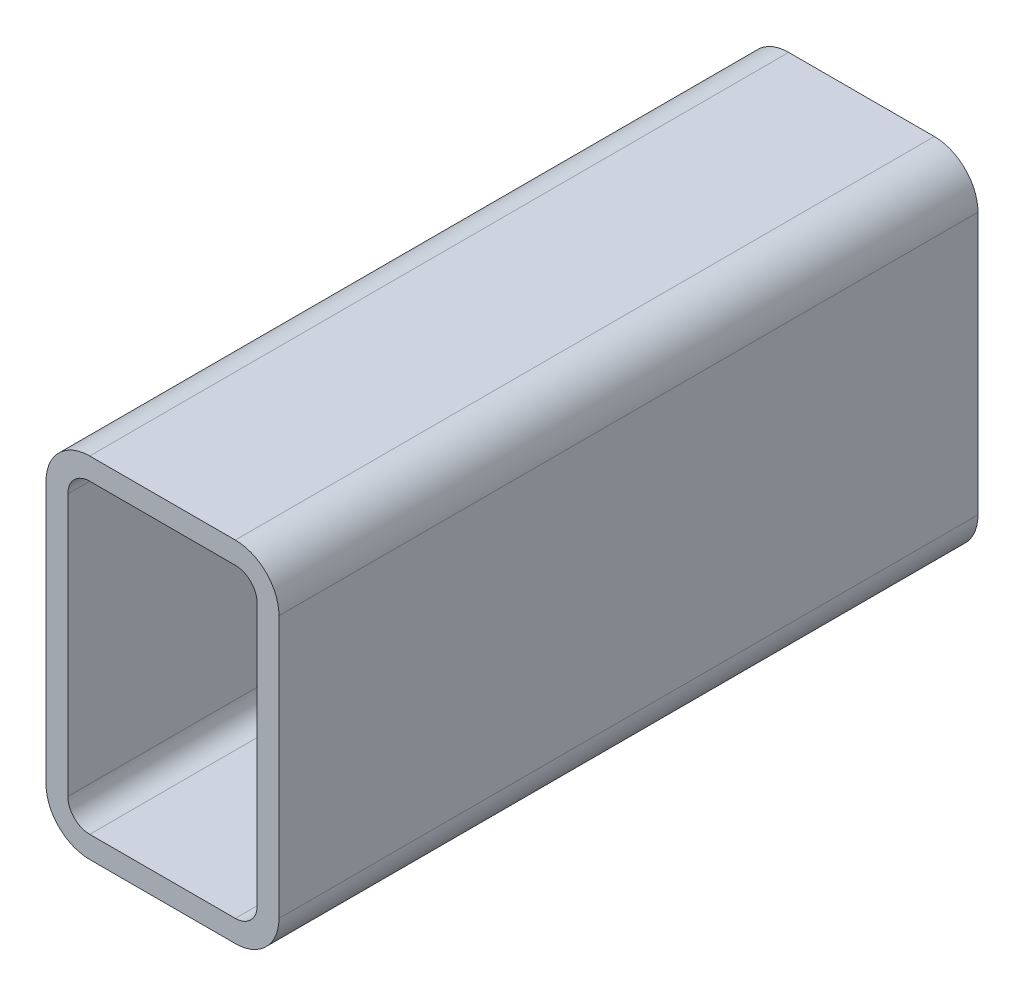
ISO-10303-21;
HEADER;
FILE_DESCRIPTION(('STEP AP214'),'2;1');
FILE_NAME('part.step','',(''),(''),'','','');
FILE_SCHEMA(('AUTOMOTIVE_DESIGN { 1 0 10303 214 1 1 1 1 }'));
ENDSEC;
DATA;
#1=APPLICATION_CONTEXT('core data for automotive mechanical design processes');
#2=APPLICATION_PROTOCOL_DEFINITION('international standard','automotive_design',2000,#1);
#3=PRODUCT_CONTEXT('',#1,'mechanical');
#4=PRODUCT('Part','Part','',(#3));
#5=PRODUCT_RELATED_PRODUCT_CATEGORY('part','',(#4));
#6=PRODUCT_DEFINITION_FORMATION('','',#4);
#7=PRODUCT_DEFINITION_CONTEXT('part definition',#1,'design');
#8=PRODUCT_DEFINITION('design','',#6,#7);
#9=PRODUCT_DEFINITION_SHAPE('','',#8);
#10=(LENGTH_UNIT() NAMED_UNIT(*) SI_UNIT(.MILLI.,.METRE.));
#11=(NAMED_UNIT(*) PLANE_ANGLE_UNIT() SI_UNIT($,.RADIAN.));
#12=(NAMED_UNIT(*) SI_UNIT($,.STERADIAN.) SOLID_ANGLE_UNIT());
#13=UNCERTAINTY_MEASURE_WITH_UNIT(LENGTH_MEASURE(1.E-05),#10,'distance_accuracy_value','');
#14=(GEOMETRIC_REPRESENTATION_CONTEXT(3) GLOBAL_UNCERTAINTY_ASSIGNED_CONTEXT((#13)) GLOBAL_UNIT_ASSIGNED_CONTEXT((#10,
#11,#12)) REPRESENTATION_CONTEXT('',''));
#15=CARTESIAN_POINT('',(0.,0.,0.));
#16=DIRECTION('',(0.,0.,1.));
#17=DIRECTION('',(1.,0.,0.));
#18=AXIS2_PLACEMENT_3D('',#15,#16,#17);
#19=CARTESIAN_POINT('',(20.7251778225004,135.361948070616,304.8));
#20=DIRECTION('',(0.,0.,1.));
#21=DIRECTION('',(1.,0.,0.));
#22=AXIS2_PLACEMENT_3D('',#19,#20,#21);
#23=PLANE('',#22);
#24=CARTESIAN_POINT('',(20.7251778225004,135.361948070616,304.8));
#25=DIRECTION('',(0.,0.,1.));
#26=DIRECTION('',(1.,0.,0.));
#27=AXIS2_PLACEMENT_3D('',#24,#25,#26);
#28=CIRCLE('',#27,19.05);
#29=CARTESIAN_POINT('',(20.7251778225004,154.411948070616,304.8));
#30=VERTEX_POINT('',#29);
#31=CARTESIAN_POINT('',(1.67517782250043,135.361948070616,304.8));
#32=VERTEX_POINT('',#31);
#33=EDGE_CURVE('E211',#30,#32,#28,.T.);
#34=ORIENTED_EDGE('',*,*,#33,.T.);
#35=DIRECTION('',(0.,-1.,0.));
#36=VECTOR('',#35,1.);
#37=CARTESIAN_POINT('',(1.67517782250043,21.0619480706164,304.8));
#38=LINE('',#37,#36);
#39=CARTESIAN_POINT('',(1.67517782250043,21.0619480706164,304.8));
#40=VERTEX_POINT('',#39);
#41=EDGE_CURVE('E214',#32,#40,#38,.T.);
#42=ORIENTED_EDGE('',*,*,#41,.T.);
#43=CARTESIAN_POINT('',(20.7251778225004,21.0619480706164,304.8));
#44=DIRECTION('',(0.,0.,1.));
#45=DIRECTION('',(1.,0.,0.));
#46=AXIS2_PLACEMENT_3D('',#43,#44,#45);
#47=CIRCLE('',#46,19.05);
#48=CARTESIAN_POINT('',(20.7251778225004,2.01194807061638,304.8));
#49=VERTEX_POINT('',#48);
#50=EDGE_CURVE('E217',#40,#49,#47,.T.);
#51=ORIENTED_EDGE('',*,*,#50,.T.);
#52=DIRECTION('',(1.,0.,0.));
#53=VECTOR('',#52,1.);
#54=CARTESIAN_POINT('',(84.2251778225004,2.01194807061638,304.8));
#55=LINE('',#54,#53);
#56=CARTESIAN_POINT('',(84.2251778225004,2.01194807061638,304.8));
#57=VERTEX_POINT('',#56);
#58=EDGE_CURVE('E219',#49,#57,#55,.T.);
#59=ORIENTED_EDGE('',*,*,#58,.T.);
#60=CARTESIAN_POINT('',(84.2251778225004,21.0619480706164,304.8));
#61=DIRECTION('',(0.,0.,1.));
#62=DIRECTION('',(1.,0.,0.));
#63=AXIS2_PLACEMENT_3D('',#60,#61,#62);
#64=CIRCLE('',#63,19.05);
#65=CARTESIAN_POINT('',(103.2751778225,21.0619480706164,304.8));
#66=VERTEX_POINT('',#65);
#67=EDGE_CURVE('E221',#57,#66,#64,.T.);
#68=ORIENTED_EDGE('',*,*,#67,.T.);
#69=DIRECTION('',(0.,1.,0.));
#70=VECTOR('',#69,1.);
#71=CARTESIAN_POINT('',(103.2751778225,135.361948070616,304.8));
#72=LINE('',#71,#70);
#73=CARTESIAN_POINT('',(103.2751778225,135.361948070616,304.8));
#74=VERTEX_POINT('',#73);
#75=EDGE_CURVE('E223',#66,#74,#72,.T.);
#76=ORIENTED_EDGE('',*,*,#75,.T.);
#77=CARTESIAN_POINT('',(84.2251778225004,135.361948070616,304.8));
#78=DIRECTION('',(0.,0.,1.));
#79=DIRECTION('',(1.,0.,0.));
#80=AXIS2_PLACEMENT_3D('',#77,#78,#79);
#81=CIRCLE('',#80,19.05);
#82=CARTESIAN_POINT('',(84.2251778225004,154.411948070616,304.8));
#83=VERTEX_POINT('',#82);
#84=EDGE_CURVE('E225',#74,#83,#81,.T.);
#85=ORIENTED_EDGE('',*,*,#84,.T.);
#86=DIRECTION('',(-1.,0.,0.));
#87=VECTOR('',#86,1.);
#88=CARTESIAN_POINT('',(20.7251778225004,154.411948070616,304.8));
#89=LINE('',#88,#87);
#90=EDGE_CURVE('E227',#83,#30,#89,.T.);
#91=ORIENTED_EDGE('',*,*,#90,.T.);
#92=EDGE_LOOP('',(#34,#42,#51,#59,#68,#76,#85,#91));
#93=FACE_BOUND('',#92,.T.);
#94=DIRECTION('',(0.,-1.,0.));
#95=VECTOR('',#94,1.);
#96=CARTESIAN_POINT('',(11.2001778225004,21.0619480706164,304.8));
#97=LINE('',#96,#95);
#98=CARTESIAN_POINT('',(11.2001778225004,135.361948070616,304.8));
#99=VERTEX_POINT('',#98);
#100=CARTESIAN_POINT('',(11.2001778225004,21.0619480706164,304.8));
#101=VERTEX_POINT('',#100);
#102=EDGE_CURVE('E154',#99,#101,#97,.T.);
#103=ORIENTED_EDGE('',*,*,#102,.F.);
#104=CARTESIAN_POINT('',(20.7251778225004,135.361948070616,304.8));
#105=DIRECTION('',(0.,0.,1.));
#106=DIRECTION('',(1.,0.,0.));
#107=AXIS2_PLACEMENT_3D('',#104,#105,#106);
#108=CIRCLE('',#107,9.52499999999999);
#109=CARTESIAN_POINT('',(20.7251778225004,144.886948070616,304.8));
#110=VERTEX_POINT('',#109);
#111=EDGE_CURVE('E146',#110,#99,#108,.T.);
#112=ORIENTED_EDGE('',*,*,#111,.F.);
#113=DIRECTION('',(-1.,0.,0.));
#114=VECTOR('',#113,1.);
#115=CARTESIAN_POINT('',(20.7251778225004,144.886948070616,304.8));
#116=LINE('',#115,#114);
#117=CARTESIAN_POINT('',(84.2251778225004,144.886948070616,304.8));
#118=VERTEX_POINT('',#117);
#119=EDGE_CURVE('E179',#118,#110,#116,.T.);
#120=ORIENTED_EDGE('',*,*,#119,.F.);
#121=CARTESIAN_POINT('',(84.2251778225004,135.361948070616,304.8));
#122=DIRECTION('',(0.,0.,1.));
#123=DIRECTION('',(1.,0.,0.));
#124=AXIS2_PLACEMENT_3D('',#121,#122,#123);
#125=CIRCLE('',#124,9.52499999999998);
#126=CARTESIAN_POINT('',(93.7501778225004,135.361948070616,304.8));
#127=VERTEX_POINT('',#126);
#128=EDGE_CURVE('E177',#127,#118,#125,.T.);
#129=ORIENTED_EDGE('',*,*,#128,.F.);
#130=DIRECTION('',(0.,1.,0.));
#131=VECTOR('',#130,1.);
#132=CARTESIAN_POINT('',(93.7501778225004,135.361948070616,304.8));
#133=LINE('',#132,#131);
#134=CARTESIAN_POINT('',(93.7501778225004,21.0619480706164,304.8));
#135=VERTEX_POINT('',#134);
#136=EDGE_CURVE('E175',#135,#127,#133,.T.);
#137=ORIENTED_EDGE('',*,*,#136,.F.);
#138=CARTESIAN_POINT('',(84.2251778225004,21.0619480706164,304.8));
#139=DIRECTION('',(0.,0.,1.));
#140=DIRECTION('',(1.,0.,0.));
#141=AXIS2_PLACEMENT_3D('',#138,#139,#140);
#142=CIRCLE('',#141,9.52500000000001);
#143=CARTESIAN_POINT('',(84.2251778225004,11.5369480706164,304.8));
#144=VERTEX_POINT('',#143);
#145=EDGE_CURVE('E173',#144,#135,#142,.T.);
#146=ORIENTED_EDGE('',*,*,#145,.F.);
#147=DIRECTION('',(1.,0.,0.));
#148=VECTOR('',#147,1.);
#149=CARTESIAN_POINT('',(84.2251778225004,11.5369480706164,304.8));
#150=LINE('',#149,#148);
#151=CARTESIAN_POINT('',(20.7251778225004,11.5369480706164,304.8));
#152=VERTEX_POINT('',#151);
#153=EDGE_CURVE('E169',#152,#144,#150,.T.);
#154=ORIENTED_EDGE('',*,*,#153,.F.);
#155=CARTESIAN_POINT('',(20.7251778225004,21.0619480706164,304.8));
#156=DIRECTION('',(0.,0.,1.));
#157=DIRECTION('',(1.,0.,0.));
#158=AXIS2_PLACEMENT_3D('',#155,#156,#157);
#159=CIRCLE('',#158,9.525);
#160=EDGE_CURVE('E167',#101,#152,#159,.T.);
#161=ORIENTED_EDGE('',*,*,#160,.F.);
#162=EDGE_LOOP('',(#103,#112,#120,#129,#137,#146,#154,#161));
#163=FACE_BOUND('',#162,.T.);
#164=ADVANCED_FACE('F33',(#93,#163),#23,.T.);
#165=CARTESIAN_POINT('',(20.7251778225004,135.361948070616,0.));
#166=DIRECTION('',(0.,0.,1.));
#167=DIRECTION('',(1.,0.,0.));
#168=AXIS2_PLACEMENT_3D('',#165,#166,#167);
#169=PLANE('',#168);
#170=CARTESIAN_POINT('',(20.7251778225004,135.361948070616,0.));
#171=DIRECTION('',(0.,0.,1.));
#172=DIRECTION('',(1.,0.,0.));
#173=AXIS2_PLACEMENT_3D('',#170,#171,#172);
#174=CIRCLE('',#173,19.05);
#175=CARTESIAN_POINT('',(20.7251778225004,154.411948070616,0.));
#176=VERTEX_POINT('',#175);
#177=CARTESIAN_POINT('',(1.67517782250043,135.361948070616,0.));
#178=VERTEX_POINT('',#177);
#179=EDGE_CURVE('E162',#176,#178,#174,.T.);
#180=ORIENTED_EDGE('',*,*,#179,.F.);
#181=DIRECTION('',(-1.,0.,0.));
#182=VECTOR('',#181,1.);
#183=CARTESIAN_POINT('',(20.7251778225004,154.411948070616,0.));
#184=LINE('',#183,#182);
#185=CARTESIAN_POINT('',(84.2251778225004,154.411948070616,0.));
#186=VERTEX_POINT('',#185);
#187=EDGE_CURVE('E215',#186,#176,#184,.T.);
#188=ORIENTED_EDGE('',*,*,#187,.F.);
#189=CARTESIAN_POINT('',(84.2251778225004,135.361948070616,0.));
#190=DIRECTION('',(0.,0.,1.));
#191=DIRECTION('',(1.,0.,0.));
#192=AXIS2_PLACEMENT_3D('',#189,#190,#191);
#193=CIRCLE('',#192,19.05);
#194=CARTESIAN_POINT('',(103.2751778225,135.361948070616,0.));
#195=VERTEX_POINT('',#194);
#196=EDGE_CURVE('E242',#195,#186,#193,.T.);
#197=ORIENTED_EDGE('',*,*,#196,.F.);
#198=DIRECTION('',(0.,1.,0.));
#199=VECTOR('',#198,1.);
#200=CARTESIAN_POINT('',(103.2751778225,135.361948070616,0.));
#201=LINE('',#200,#199);
#202=CARTESIAN_POINT('',(103.2751778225,21.0619480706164,0.));
#203=VERTEX_POINT('',#202);
#204=EDGE_CURVE('E240',#203,#195,#201,.T.);
#205=ORIENTED_EDGE('',*,*,#204,.F.);
#206=CARTESIAN_POINT('',(84.2251778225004,21.0619480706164,0.));
#207=DIRECTION('',(0.,0.,1.));
#208=DIRECTION('',(1.,0.,0.));
#209=AXIS2_PLACEMENT_3D('',#206,#207,#208);
#210=CIRCLE('',#209,19.05);
#211=CARTESIAN_POINT('',(84.2251778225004,2.01194807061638,0.));
#212=VERTEX_POINT('',#211);
#213=EDGE_CURVE('E238',#212,#203,#210,.T.);
#214=ORIENTED_EDGE('',*,*,#213,.F.);
#215=DIRECTION('',(1.,0.,0.));
#216=VECTOR('',#215,1.);
#217=CARTESIAN_POINT('',(84.2251778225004,2.01194807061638,0.));
#218=LINE('',#217,#216);
#219=CARTESIAN_POINT('',(20.7251778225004,2.01194807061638,0.));
#220=VERTEX_POINT('',#219);
#221=EDGE_CURVE('E236',#220,#212,#218,.T.);
#222=ORIENTED_EDGE('',*,*,#221,.F.);
#223=CARTESIAN_POINT('',(20.7251778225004,21.0619480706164,0.));
#224=DIRECTION('',(0.,0.,1.));
#225=DIRECTION('',(1.,0.,0.));
#226=AXIS2_PLACEMENT_3D('',#223,#224,#225);
#227=CIRCLE('',#226,19.05);
#228=CARTESIAN_POINT('',(1.67517782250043,21.0619480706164,0.));
#229=VERTEX_POINT('',#228);
#230=EDGE_CURVE('E234',#229,#220,#227,.T.);
#231=ORIENTED_EDGE('',*,*,#230,.F.);
#232=DIRECTION('',(0.,-1.,0.));
#233=VECTOR('',#232,1.);
#234=CARTESIAN_POINT('',(1.67517782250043,21.0619480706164,0.));
#235=LINE('',#234,#233);
#236=EDGE_CURVE('E232',#178,#229,#235,.T.);
#237=ORIENTED_EDGE('',*,*,#236,.F.);
#238=EDGE_LOOP('',(#180,#188,#197,#205,#214,#222,#231,#237));
#239=FACE_BOUND('',#238,.T.);
#240=CARTESIAN_POINT('',(20.7251778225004,135.361948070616,0.));
#241=DIRECTION('',(0.,0.,1.));
#242=DIRECTION('',(1.,0.,0.));
#243=AXIS2_PLACEMENT_3D('',#240,#241,#242);
#244=CIRCLE('',#243,9.52499999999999);
#245=CARTESIAN_POINT('',(20.7251778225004,144.886948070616,0.));
#246=VERTEX_POINT('',#245);
#247=CARTESIAN_POINT('',(11.2001778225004,135.361948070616,0.));
#248=VERTEX_POINT('',#247);
#249=EDGE_CURVE('E56',#246,#248,#244,.T.);
#250=ORIENTED_EDGE('',*,*,#249,.T.);
#251=DIRECTION('',(0.,-1.,0.));
#252=VECTOR('',#251,1.);
#253=CARTESIAN_POINT('',(11.2001778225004,21.0619480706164,0.));
#254=LINE('',#253,#252);
#255=CARTESIAN_POINT('',(11.2001778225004,21.0619480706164,0.));
#256=VERTEX_POINT('',#255);
#257=EDGE_CURVE('E161',#248,#256,#254,.T.);
#258=ORIENTED_EDGE('',*,*,#257,.T.);
#259=CARTESIAN_POINT('',(20.7251778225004,21.0619480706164,0.));
#260=DIRECTION('',(0.,0.,1.));
#261=DIRECTION('',(1.,0.,0.));
#262=AXIS2_PLACEMENT_3D('',#259,#260,#261);
#263=CIRCLE('',#262,9.525);
#264=CARTESIAN_POINT('',(20.7251778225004,11.5369480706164,0.));
#265=VERTEX_POINT('',#264);
#266=EDGE_CURVE('E183',#256,#265,#263,.T.);
#267=ORIENTED_EDGE('',*,*,#266,.T.);
#268=DIRECTION('',(1.,0.,0.));
#269=VECTOR('',#268,1.);
#270=CARTESIAN_POINT('',(84.2251778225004,11.5369480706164,0.));
#271=LINE('',#270,#269);
#272=CARTESIAN_POINT('',(84.2251778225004,11.5369480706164,0.));
#273=VERTEX_POINT('',#272);
#274=EDGE_CURVE('E186',#265,#273,#271,.T.);
#275=ORIENTED_EDGE('',*,*,#274,.T.);
#276=CARTESIAN_POINT('',(84.2251778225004,21.0619480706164,0.));
#277=DIRECTION('',(0.,0.,1.));
#278=DIRECTION('',(1.,0.,0.));
#279=AXIS2_PLACEMENT_3D('',#276,#277,#278);
#280=CIRCLE('',#279,9.52500000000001);
#281=CARTESIAN_POINT('',(93.7501778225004,21.0619480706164,0.));
#282=VERTEX_POINT('',#281);
#283=EDGE_CURVE('E189',#273,#282,#280,.T.);
#284=ORIENTED_EDGE('',*,*,#283,.T.);
#285=DIRECTION('',(0.,1.,0.));
#286=VECTOR('',#285,1.);
#287=CARTESIAN_POINT('',(93.7501778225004,135.361948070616,0.));
#288=LINE('',#287,#286);
#289=CARTESIAN_POINT('',(93.7501778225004,135.361948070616,0.));
#290=VERTEX_POINT('',#289);
#291=EDGE_CURVE('E192',#282,#290,#288,.T.);
#292=ORIENTED_EDGE('',*,*,#291,.T.);
#293=CARTESIAN_POINT('',(84.2251778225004,135.361948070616,0.));
#294=DIRECTION('',(0.,0.,1.));
#295=DIRECTION('',(1.,0.,0.));
#296=AXIS2_PLACEMENT_3D('',#293,#294,#295);
#297=CIRCLE('',#296,9.52499999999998);
#298=CARTESIAN_POINT('',(84.2251778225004,144.886948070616,0.));
#299=VERTEX_POINT('',#298);
#300=EDGE_CURVE('E195',#290,#299,#297,.T.);
#301=ORIENTED_EDGE('',*,*,#300,.T.);
#302=DIRECTION('',(-1.,0.,0.));
#303=VECTOR('',#302,1.);
#304=CARTESIAN_POINT('',(20.7251778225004,144.886948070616,0.));
#305=LINE('',#304,#303);
#306=EDGE_CURVE('E155',#299,#246,#305,.T.);
#307=ORIENTED_EDGE('',*,*,#306,.T.);
#308=EDGE_LOOP('',(#250,#258,#267,#275,#284,#292,#301,#307));
#309=FACE_BOUND('',#308,.T.);
#310=ADVANCED_FACE('F272',(#239,#309),#169,.F.);
#311=CARTESIAN_POINT('',(20.7251778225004,135.361948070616,304.8));
#312=DIRECTION('',(0.,0.,-1.));
#313=DIRECTION('',(-1.,0.,0.));
#314=AXIS2_PLACEMENT_3D('',#311,#312,#313);
#315=CYLINDRICAL_SURFACE('',#314,19.05);
#316=ORIENTED_EDGE('',*,*,#179,.T.);
#317=DIRECTION('',(0.,0.,-1.));
#318=VECTOR('',#317,1.);
#319=CARTESIAN_POINT('',(1.67517782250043,135.361948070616,304.8));
#320=LINE('',#319,#318);
#321=EDGE_CURVE('E11',#32,#178,#320,.T.);
#322=ORIENTED_EDGE('',*,*,#321,.F.);
#323=ORIENTED_EDGE('',*,*,#33,.F.);
#324=DIRECTION('',(0.,0.,-1.));
#325=VECTOR('',#324,1.);
#326=CARTESIAN_POINT('',(20.7251778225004,154.411948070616,304.8));
#327=LINE('',#326,#325);
#328=EDGE_CURVE('E229',#30,#176,#327,.T.);
#329=ORIENTED_EDGE('',*,*,#328,.T.);
#330=EDGE_LOOP('',(#316,#322,#323,#329));
#331=FACE_BOUND('',#330,.T.);
#332=ADVANCED_FACE('F35',(#331),#315,.T.);
#333=CARTESIAN_POINT('',(1.67517782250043,21.0619480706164,304.8));
#334=DIRECTION('',(1.,0.,0.));
#335=DIRECTION('',(0.,0.,-1.));
#336=AXIS2_PLACEMENT_3D('',#333,#334,#335);
#337=PLANE('',#336);
#338=ORIENTED_EDGE('',*,*,#236,.T.);
#339=DIRECTION('',(0.,0.,-1.));
#340=VECTOR('',#339,1.);
#341=CARTESIAN_POINT('',(1.67517782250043,21.0619480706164,304.8));
#342=LINE('',#341,#340);
#343=EDGE_CURVE('E41',#40,#229,#342,.T.);
#344=ORIENTED_EDGE('',*,*,#343,.F.);
#345=ORIENTED_EDGE('',*,*,#41,.F.);
#346=ORIENTED_EDGE('',*,*,#321,.T.);
#347=EDGE_LOOP('',(#338,#344,#345,#346));
#348=FACE_BOUND('',#347,.T.);
#349=ADVANCED_FACE('F289',(#348),#337,.F.);
#350=CARTESIAN_POINT('',(20.7251778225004,21.0619480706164,304.8));
#351=DIRECTION('',(0.,0.,-1.));
#352=DIRECTION('',(-1.,0.,0.));
#353=AXIS2_PLACEMENT_3D('',#350,#351,#352);
#354=CYLINDRICAL_SURFACE('',#353,19.05);
#355=ORIENTED_EDGE('',*,*,#230,.T.);
#356=DIRECTION('',(0.,0.,-1.));
#357=VECTOR('',#356,1.);
#358=CARTESIAN_POINT('',(20.7251778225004,2.01194807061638,304.8));
#359=LINE('',#358,#357);
#360=EDGE_CURVE('E259',#49,#220,#359,.T.);
#361=ORIENTED_EDGE('',*,*,#360,.F.);
#362=ORIENTED_EDGE('',*,*,#50,.F.);
#363=ORIENTED_EDGE('',*,*,#343,.T.);
#364=EDGE_LOOP('',(#355,#361,#362,#363));
#365=FACE_BOUND('',#364,.T.);
#366=ADVANCED_FACE('F266',(#365),#354,.T.);
#367=CARTESIAN_POINT('',(84.2251778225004,2.01194807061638,304.8));
#368=DIRECTION('',(0.,1.,0.));
#369=DIRECTION('',(0.,0.,1.));
#370=AXIS2_PLACEMENT_3D('',#367,#368,#369);
#371=PLANE('',#370);
#372=ORIENTED_EDGE('',*,*,#221,.T.);
#373=DIRECTION('',(0.,0.,-1.));
#374=VECTOR('',#373,1.);
#375=CARTESIAN_POINT('',(84.2251778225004,2.01194807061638,304.8));
#376=LINE('',#375,#374);
#377=EDGE_CURVE('E256',#57,#212,#376,.T.);
#378=ORIENTED_EDGE('',*,*,#377,.F.);
#379=ORIENTED_EDGE('',*,*,#58,.F.);
#380=ORIENTED_EDGE('',*,*,#360,.T.);
#381=EDGE_LOOP('',(#372,#378,#379,#380));
#382=FACE_BOUND('',#381,.T.);
#383=ADVANCED_FACE('F278',(#382),#371,.F.);
#384=CARTESIAN_POINT('',(84.2251778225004,21.0619480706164,304.8));
#385=DIRECTION('',(0.,0.,-1.));
#386=DIRECTION('',(-1.,0.,0.));
#387=AXIS2_PLACEMENT_3D('',#384,#385,#386);
#388=CYLINDRICAL_SURFACE('',#387,19.05);
#389=ORIENTED_EDGE('',*,*,#213,.T.);
#390=DIRECTION('',(0.,0.,-1.));
#391=VECTOR('',#390,1.);
#392=CARTESIAN_POINT('',(103.2751778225,21.0619480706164,304.8));
#393=LINE('',#392,#391);
#394=EDGE_CURVE('E253',#66,#203,#393,.T.);
#395=ORIENTED_EDGE('',*,*,#394,.F.);
#396=ORIENTED_EDGE('',*,*,#67,.F.);
#397=ORIENTED_EDGE('',*,*,#377,.T.);
#398=EDGE_LOOP('',(#389,#395,#396,#397));
#399=FACE_BOUND('',#398,.T.);
#400=ADVANCED_FACE('F282',(#399),#388,.T.);
#401=CARTESIAN_POINT('',(103.2751778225,135.361948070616,304.8));
#402=DIRECTION('',(-1.,0.,0.));
#403=DIRECTION('',(0.,0.,1.));
#404=AXIS2_PLACEMENT_3D('',#401,#402,#403);
#405=PLANE('',#404);
#406=ORIENTED_EDGE('',*,*,#204,.T.);
#407=DIRECTION('',(0.,0.,-1.));
#408=VECTOR('',#407,1.);
#409=CARTESIAN_POINT('',(103.2751778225,135.361948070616,304.8));
#410=LINE('',#409,#408);
#411=EDGE_CURVE('E250',#74,#195,#410,.T.);
#412=ORIENTED_EDGE('',*,*,#411,.F.);
#413=ORIENTED_EDGE('',*,*,#75,.F.);
#414=ORIENTED_EDGE('',*,*,#394,.T.);
#415=EDGE_LOOP('',(#406,#412,#413,#414));
#416=FACE_BOUND('',#415,.T.);
#417=ADVANCED_FACE('F302',(#416),#405,.F.);
#418=CARTESIAN_POINT('',(84.2251778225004,135.361948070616,304.8));
#419=DIRECTION('',(0.,0.,-1.));
#420=DIRECTION('',(-1.,0.,0.));
#421=AXIS2_PLACEMENT_3D('',#418,#419,#420);
#422=CYLINDRICAL_SURFACE('',#421,19.05);
#423=ORIENTED_EDGE('',*,*,#196,.T.);
#424=DIRECTION('',(0.,0.,-1.));
#425=VECTOR('',#424,1.);
#426=CARTESIAN_POINT('',(84.2251778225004,154.411948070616,304.8));
#427=LINE('',#426,#425);
#428=EDGE_CURVE('E247',#83,#186,#427,.T.);
#429=ORIENTED_EDGE('',*,*,#428,.F.);
#430=ORIENTED_EDGE('',*,*,#84,.F.);
#431=ORIENTED_EDGE('',*,*,#411,.T.);
#432=EDGE_LOOP('',(#423,#429,#430,#431));
#433=FACE_BOUND('',#432,.T.);
#434=ADVANCED_FACE('F300',(#433),#422,.T.);
#435=CARTESIAN_POINT('',(20.7251778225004,154.411948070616,304.8));
#436=DIRECTION('',(0.,-1.,0.));
#437=DIRECTION('',(0.,0.,-1.));
#438=AXIS2_PLACEMENT_3D('',#435,#436,#437);
#439=PLANE('',#438);
#440=ORIENTED_EDGE('',*,*,#187,.T.);
#441=ORIENTED_EDGE('',*,*,#328,.F.);
#442=ORIENTED_EDGE('',*,*,#90,.F.);
#443=ORIENTED_EDGE('',*,*,#428,.T.);
#444=EDGE_LOOP('',(#440,#441,#442,#443));
#445=FACE_BOUND('',#444,.T.);
#446=ADVANCED_FACE('F295',(#445),#439,.F.);
#447=CARTESIAN_POINT('',(20.7251778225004,135.361948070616,304.8));
#448=DIRECTION('',(0.,0.,-1.));
#449=DIRECTION('',(-1.,0.,0.));
#450=AXIS2_PLACEMENT_3D('',#447,#448,#449);
#451=CYLINDRICAL_SURFACE('',#450,9.52499999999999);
#452=ORIENTED_EDGE('',*,*,#249,.F.);
#453=DIRECTION('',(0.,0.,-1.));
#454=VECTOR('',#453,1.);
#455=CARTESIAN_POINT('',(20.7251778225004,144.886948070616,304.8));
#456=LINE('',#455,#454);
#457=EDGE_CURVE('E150',#110,#246,#456,.T.);
#458=ORIENTED_EDGE('',*,*,#457,.F.);
#459=ORIENTED_EDGE('',*,*,#111,.T.);
#460=DIRECTION('',(0.,0.,-1.));
#461=VECTOR('',#460,1.);
#462=CARTESIAN_POINT('',(11.2001778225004,135.361948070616,304.8));
#463=LINE('',#462,#461);
#464=EDGE_CURVE('E149',#99,#248,#463,.T.);
#465=ORIENTED_EDGE('',*,*,#464,.T.);
#466=EDGE_LOOP('',(#452,#458,#459,#465));
#467=FACE_BOUND('',#466,.T.);
#468=ADVANCED_FACE('F148',(#467),#451,.F.);
#469=CARTESIAN_POINT('',(11.2001778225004,21.0619480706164,304.8));
#470=DIRECTION('',(1.,0.,0.));
#471=DIRECTION('',(0.,0.,-1.));
#472=AXIS2_PLACEMENT_3D('',#469,#470,#471);
#473=PLANE('',#472);
#474=ORIENTED_EDGE('',*,*,#257,.F.);
#475=ORIENTED_EDGE('',*,*,#464,.F.);
#476=ORIENTED_EDGE('',*,*,#102,.T.);
#477=DIRECTION('',(0.,0.,-1.));
#478=VECTOR('',#477,1.);
#479=CARTESIAN_POINT('',(11.2001778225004,21.0619480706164,304.8));
#480=LINE('',#479,#478);
#481=EDGE_CURVE('E163',#101,#256,#480,.T.);
#482=ORIENTED_EDGE('',*,*,#481,.T.);
#483=EDGE_LOOP('',(#474,#475,#476,#482));
#484=FACE_BOUND('',#483,.T.);
#485=ADVANCED_FACE('F158',(#484),#473,.T.);
#486=CARTESIAN_POINT('',(20.7251778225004,21.0619480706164,304.8));
#487=DIRECTION('',(0.,0.,-1.));
#488=DIRECTION('',(-1.,0.,0.));
#489=AXIS2_PLACEMENT_3D('',#486,#487,#488);
#490=CYLINDRICAL_SURFACE('',#489,9.525);
#491=ORIENTED_EDGE('',*,*,#266,.F.);
#492=ORIENTED_EDGE('',*,*,#481,.F.);
#493=ORIENTED_EDGE('',*,*,#160,.T.);
#494=DIRECTION('',(0.,0.,-1.));
#495=VECTOR('',#494,1.);
#496=CARTESIAN_POINT('',(20.7251778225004,11.5369480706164,304.8));
#497=LINE('',#496,#495);
#498=EDGE_CURVE('E208',#152,#265,#497,.T.);
#499=ORIENTED_EDGE('',*,*,#498,.T.);
#500=EDGE_LOOP('',(#491,#492,#493,#499));
#501=FACE_BOUND('',#500,.T.);
#502=ADVANCED_FACE('F327',(#501),#490,.F.);
#503=CARTESIAN_POINT('',(84.2251778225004,11.5369480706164,304.8));
#504=DIRECTION('',(0.,1.,0.));
#505=DIRECTION('',(0.,0.,1.));
#506=AXIS2_PLACEMENT_3D('',#503,#504,#505);
#507=PLANE('',#506);
#508=ORIENTED_EDGE('',*,*,#274,.F.);
#509=ORIENTED_EDGE('',*,*,#498,.F.);
#510=ORIENTED_EDGE('',*,*,#153,.T.);
#511=DIRECTION('',(0.,0.,-1.));
#512=VECTOR('',#511,1.);
#513=CARTESIAN_POINT('',(84.2251778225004,11.5369480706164,304.8));
#514=LINE('',#513,#512);
#515=EDGE_CURVE('E206',#144,#273,#514,.T.);
#516=ORIENTED_EDGE('',*,*,#515,.T.);
#517=EDGE_LOOP('',(#508,#509,#510,#516));
#518=FACE_BOUND('',#517,.T.);
#519=ADVANCED_FACE('F331',(#518),#507,.T.);
#520=CARTESIAN_POINT('',(84.2251778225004,21.0619480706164,304.8));
#521=DIRECTION('',(0.,0.,-1.));
#522=DIRECTION('',(-1.,0.,0.));
#523=AXIS2_PLACEMENT_3D('',#520,#521,#522);
#524=CYLINDRICAL_SURFACE('',#523,9.52500000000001);
#525=ORIENTED_EDGE('',*,*,#283,.F.);
#526=ORIENTED_EDGE('',*,*,#515,.F.);
#527=ORIENTED_EDGE('',*,*,#145,.T.);
#528=DIRECTION('',(0.,0.,-1.));
#529=VECTOR('',#528,1.);
#530=CARTESIAN_POINT('',(93.7501778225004,21.0619480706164,304.8));
#531=LINE('',#530,#529);
#532=EDGE_CURVE('E204',#135,#282,#531,.T.);
#533=ORIENTED_EDGE('',*,*,#532,.T.);
#534=EDGE_LOOP('',(#525,#526,#527,#533));
#535=FACE_BOUND('',#534,.T.);
#536=ADVANCED_FACE('F337',(#535),#524,.F.);
#537=CARTESIAN_POINT('',(93.7501778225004,135.361948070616,304.8));
#538=DIRECTION('',(-1.,0.,0.));
#539=DIRECTION('',(0.,0.,1.));
#540=AXIS2_PLACEMENT_3D('',#537,#538,#539);
#541=PLANE('',#540);
#542=ORIENTED_EDGE('',*,*,#291,.F.);
#543=ORIENTED_EDGE('',*,*,#532,.F.);
#544=ORIENTED_EDGE('',*,*,#136,.T.);
#545=DIRECTION('',(0.,0.,-1.));
#546=VECTOR('',#545,1.);
#547=CARTESIAN_POINT('',(93.7501778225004,135.361948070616,304.8));
#548=LINE('',#547,#546);
#549=EDGE_CURVE('E202',#127,#290,#548,.T.);
#550=ORIENTED_EDGE('',*,*,#549,.T.);
#551=EDGE_LOOP('',(#542,#543,#544,#550));
#552=FACE_BOUND('',#551,.T.);
#553=ADVANCED_FACE('F341',(#552),#541,.T.);
#554=CARTESIAN_POINT('',(84.2251778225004,135.361948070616,304.8));
#555=DIRECTION('',(0.,0.,-1.));
#556=DIRECTION('',(-1.,0.,0.));
#557=AXIS2_PLACEMENT_3D('',#554,#555,#556);
#558=CYLINDRICAL_SURFACE('',#557,9.52499999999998);
#559=ORIENTED_EDGE('',*,*,#300,.F.);
#560=ORIENTED_EDGE('',*,*,#549,.F.);
#561=ORIENTED_EDGE('',*,*,#128,.T.);
#562=DIRECTION('',(0.,0.,-1.));
#563=VECTOR('',#562,1.);
#564=CARTESIAN_POINT('',(84.2251778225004,144.886948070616,304.8));
#565=LINE('',#564,#563);
#566=EDGE_CURVE('E48',#118,#299,#565,.T.);
#567=ORIENTED_EDGE('',*,*,#566,.T.);
#568=EDGE_LOOP('',(#559,#560,#561,#567));
#569=FACE_BOUND('',#568,.T.);
#570=ADVANCED_FACE('F345',(#569),#558,.F.);
#571=CARTESIAN_POINT('',(20.7251778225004,144.886948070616,304.8));
#572=DIRECTION('',(0.,-1.,0.));
#573=DIRECTION('',(0.,0.,-1.));
#574=AXIS2_PLACEMENT_3D('',#571,#572,#573);
#575=PLANE('',#574);
#576=ORIENTED_EDGE('',*,*,#306,.F.);
#577=ORIENTED_EDGE('',*,*,#566,.F.);
#578=ORIENTED_EDGE('',*,*,#119,.T.);
#579=ORIENTED_EDGE('',*,*,#457,.T.);
#580=EDGE_LOOP('',(#576,#577,#578,#579));
#581=FACE_BOUND('',#580,.T.);
#582=ADVANCED_FACE('F349',(#581),#575,.T.);
#583=CLOSED_SHELL('',(#164,#310,#332,#349,#366,#383,#400,#417,#434,#446,#468,#485,#502,#519,
#536,#553,#570,#582));
#584=MANIFOLD_SOLID_BREP('B2',#583);
#585=ADVANCED_BREP_SHAPE_REPRESENTATION('',(#18,#584),#14);
#586=SHAPE_DEFINITION_REPRESENTATION(#9,#585);
ENDSEC;
END-ISO-10303-21;
